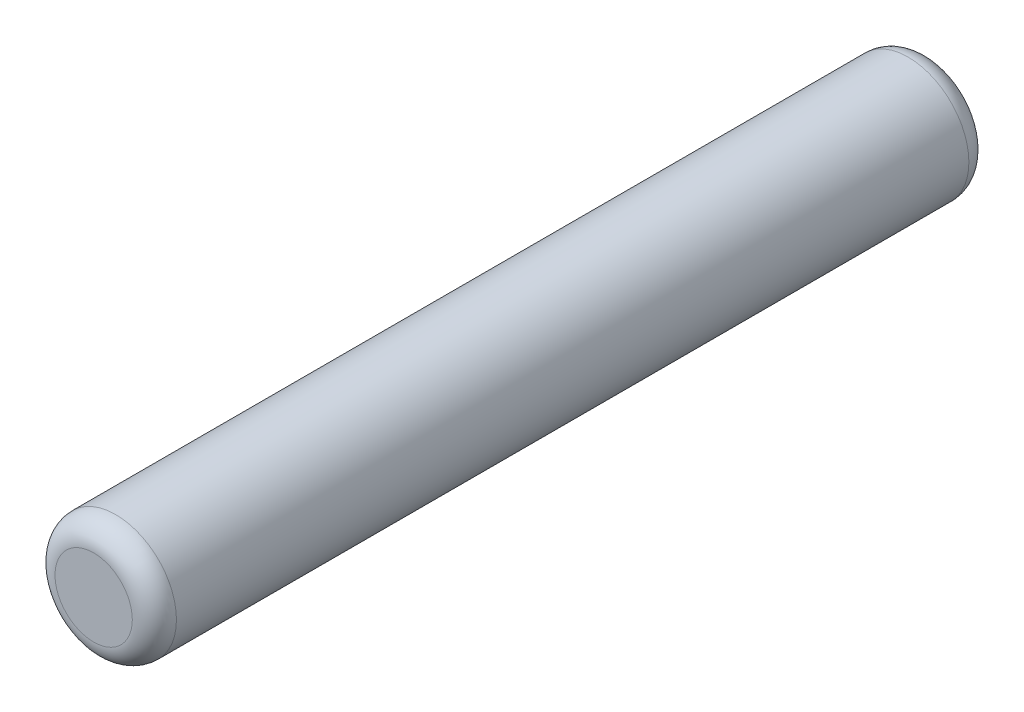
from build123d import *


with BuildPart() as part:
    # Sketch 1 → Revolve 1 (revolve)
    with BuildSketch(Plane(origin=(0, 0, 0), x_dir=(0, 0, -1), z_dir=(1, 0, 0)), mode=Mode.PRIVATE) as revolve_1_sk:
        with BuildLine():
            Line((15.0495, 0), (-15.0495, 0))
            Line((-15.0495, 0), (-15.0495, 1.39065))
            ThreePointArc((-15.0495, 1.39065), (-14.817016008, 1.951916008), (-14.25575, 2.1844))
            Line((-14.25575, 2.1844), (14.25575, 2.1844))
            ThreePointArc((14.25575, 2.1844), (14.817016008, 1.951916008), (15.0495, 1.39065))
            Line((15.0495, 1.39065), (15.0495, 0))
        make_face()
    revolve(revolve_1_sk.sketch.rotate(Axis((0, 0, 40.423273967), (0, 0, -1)), 90), axis=Axis((0, 0, 40.423273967), (0, 0, -1)))


solid = part.part
